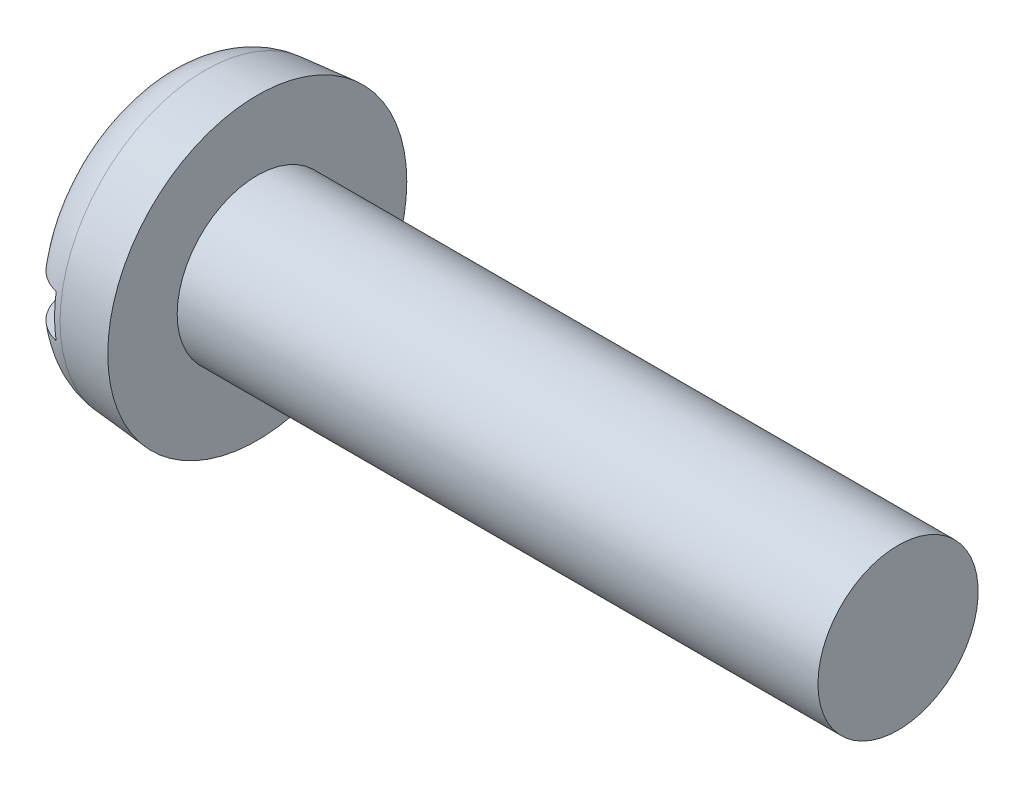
ISO-10303-21;
HEADER;
FILE_DESCRIPTION(('STEP AP214'),'2;1');
FILE_NAME('part.step','',(''),(''),'','','');
FILE_SCHEMA(('AUTOMOTIVE_DESIGN { 1 0 10303 214 1 1 1 1 }'));
ENDSEC;
DATA;
#1=APPLICATION_CONTEXT('core data for automotive mechanical design processes');
#2=APPLICATION_PROTOCOL_DEFINITION('international standard','automotive_design',2000,#1);
#3=PRODUCT_CONTEXT('',#1,'mechanical');
#4=PRODUCT('Part','Part','',(#3));
#5=PRODUCT_RELATED_PRODUCT_CATEGORY('part','',(#4));
#6=PRODUCT_DEFINITION_FORMATION('','',#4);
#7=PRODUCT_DEFINITION_CONTEXT('part definition',#1,'design');
#8=PRODUCT_DEFINITION('design','',#6,#7);
#9=PRODUCT_DEFINITION_SHAPE('','',#8);
#10=(LENGTH_UNIT() NAMED_UNIT(*) SI_UNIT(.MILLI.,.METRE.));
#11=(NAMED_UNIT(*) PLANE_ANGLE_UNIT() SI_UNIT($,.RADIAN.));
#12=(NAMED_UNIT(*) SI_UNIT($,.STERADIAN.) SOLID_ANGLE_UNIT());
#13=UNCERTAINTY_MEASURE_WITH_UNIT(LENGTH_MEASURE(1.E-05),#10,'distance_accuracy_value','');
#14=(GEOMETRIC_REPRESENTATION_CONTEXT(3) GLOBAL_UNCERTAINTY_ASSIGNED_CONTEXT((#13)) GLOBAL_UNIT_ASSIGNED_CONTEXT((#10,
#11,#12)) REPRESENTATION_CONTEXT('',''));
#15=CARTESIAN_POINT('',(0.,0.,0.));
#16=DIRECTION('',(0.,0.,1.));
#17=DIRECTION('',(1.,0.,0.));
#18=AXIS2_PLACEMENT_3D('',#15,#16,#17);
#19=CARTESIAN_POINT('',(0.,0.,0.));
#20=DIRECTION('',(-1.,0.,0.));
#21=DIRECTION('',(0.,0.,1.));
#22=AXIS2_PLACEMENT_3D('',#19,#20,#21);
#23=PLANE('',#22);
#24=DIRECTION('',(0.,0.,-1.));
#25=VECTOR('',#24,1.);
#26=CARTESIAN_POINT('',(0.,0.399999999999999,2.8));
#27=LINE('',#26,#25);
#28=CARTESIAN_POINT('',(0.,0.399999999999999,1.77326763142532));
#29=VERTEX_POINT('',#28);
#30=CARTESIAN_POINT('',(0.,0.399999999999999,-1.77326763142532));
#31=VERTEX_POINT('',#30);
#32=EDGE_CURVE('E85',#29,#31,#27,.T.);
#33=ORIENTED_EDGE('',*,*,#32,.F.);
#34=CARTESIAN_POINT('',(0.,0.,0.));
#35=DIRECTION('',(-1.,0.,0.));
#36=DIRECTION('',(0.,0.,1.));
#37=AXIS2_PLACEMENT_3D('',#34,#35,#36);
#38=CIRCLE('',#37,1.81782234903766);
#39=EDGE_CURVE('E91',#29,#31,#38,.T.);
#40=ORIENTED_EDGE('',*,*,#39,.T.);
#41=EDGE_LOOP('',(#33,#40));
#42=FACE_BOUND('',#41,.T.);
#43=ADVANCED_FACE('F32',(#42),#23,.T.);
#44=CARTESIAN_POINT('',(-25.4,0.,0.));
#45=DIRECTION('',(-1.,0.,0.));
#46=DIRECTION('',(0.,0.,1.));
#47=AXIS2_PLACEMENT_3D('',#44,#45,#46);
#48=CYLINDRICAL_SURFACE('',#47,1.5);
#49=CARTESIAN_POINT('',(13.8,0.,0.));
#50=DIRECTION('',(-1.,0.,0.));
#51=DIRECTION('',(0.,0.,1.));
#52=AXIS2_PLACEMENT_3D('',#49,#50,#51);
#53=CIRCLE('',#52,1.5);
#54=CARTESIAN_POINT('',(13.8,0.,1.5));
#55=VERTEX_POINT('',#54);
#56=EDGE_CURVE('E92',#55,#55,#53,.T.);
#57=ORIENTED_EDGE('',*,*,#56,.T.);
#58=EDGE_LOOP('',(#57));
#59=FACE_BOUND('',#58,.T.);
#60=CARTESIAN_POINT('',(1.8,0.,0.));
#61=DIRECTION('',(-1.,0.,0.));
#62=DIRECTION('',(0.,0.,1.));
#63=AXIS2_PLACEMENT_3D('',#60,#61,#62);
#64=CIRCLE('',#63,1.5);
#65=CARTESIAN_POINT('',(1.8,0.,1.5));
#66=VERTEX_POINT('',#65);
#67=EDGE_CURVE('E149',#66,#66,#64,.T.);
#68=ORIENTED_EDGE('',*,*,#67,.F.);
#69=EDGE_LOOP('',(#68));
#70=FACE_BOUND('',#69,.T.);
#71=ADVANCED_FACE('F137',(#59,#70),#48,.T.);
#72=CARTESIAN_POINT('',(13.8,1.5,0.));
#73=DIRECTION('',(1.,0.,0.));
#74=DIRECTION('',(0.,0.,-1.));
#75=AXIS2_PLACEMENT_3D('',#72,#73,#74);
#76=PLANE('',#75);
#77=ORIENTED_EDGE('',*,*,#56,.F.);
#78=EDGE_LOOP('',(#77));
#79=FACE_BOUND('',#78,.T.);
#80=ADVANCED_FACE('F135',(#79),#76,.T.);
#81=DIRECTION('',(0.,0.,1.));
#82=VECTOR('',#81,1.);
#83=CARTESIAN_POINT('',(0.,-0.4,-2.8));
#84=LINE('',#83,#82);
#85=CARTESIAN_POINT('',(0.,-0.4,-1.77326763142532));
#86=VERTEX_POINT('',#85);
#87=CARTESIAN_POINT('',(0.,-0.4,1.77326763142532));
#88=VERTEX_POINT('',#87);
#89=EDGE_CURVE('E76',#86,#88,#84,.T.);
#90=ORIENTED_EDGE('',*,*,#89,.F.);
#91=EDGE_CURVE('E83',#86,#88,#38,.T.);
#92=ORIENTED_EDGE('',*,*,#91,.T.);
#93=EDGE_LOOP('',(#90,#92));
#94=FACE_BOUND('',#93,.T.);
#95=ADVANCED_FACE('F82',(#94),#23,.T.);
#96=CARTESIAN_POINT('',(0.,0.,0.));
#97=DIRECTION('',(1.,0.,0.));
#98=DIRECTION('',(0.,0.,-1.));
#99=AXIS2_PLACEMENT_3D('',#96,#97,#98);
#100=CONICAL_SURFACE('',#99,2.64252040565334,0.087266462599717);
#101=CARTESIAN_POINT('',(0.821559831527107,0.,0.));
#102=DIRECTION('',(-1.,0.,0.));
#103=DIRECTION('',(0.,0.,1.));
#104=AXIS2_PLACEMENT_3D('',#101,#102,#103);
#105=CIRCLE('',#104,2.71439757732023);
#106=CARTESIAN_POINT('',(0.821559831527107,0.,2.71439757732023));
#107=VERTEX_POINT('',#106);
#108=EDGE_CURVE('E95',#107,#107,#105,.F.);
#109=ORIENTED_EDGE('',*,*,#108,.T.);
#110=EDGE_LOOP('',(#109));
#111=FACE_BOUND('',#110,.T.);
#112=CARTESIAN_POINT('',(1.8,0.,0.));
#113=DIRECTION('',(-1.,0.,0.));
#114=DIRECTION('',(0.,0.,1.));
#115=AXIS2_PLACEMENT_3D('',#112,#113,#114);
#116=CIRCLE('',#115,2.8);
#117=CARTESIAN_POINT('',(1.8,0.,2.8));
#118=VERTEX_POINT('',#117);
#119=EDGE_CURVE('E97',#118,#118,#116,.T.);
#120=ORIENTED_EDGE('',*,*,#119,.T.);
#121=EDGE_LOOP('',(#120));
#122=FACE_BOUND('',#121,.T.);
#123=ADVANCED_FACE('F128',(#111,#122),#100,.T.);
#124=CARTESIAN_POINT('',(1.8,1.5,0.));
#125=DIRECTION('',(-1.,0.,0.));
#126=DIRECTION('',(0.,0.,1.));
#127=AXIS2_PLACEMENT_3D('',#124,#125,#126);
#128=PLANE('',#127);
#129=ORIENTED_EDGE('',*,*,#119,.F.);
#130=EDGE_LOOP('',(#129));
#131=FACE_BOUND('',#130,.T.);
#132=ORIENTED_EDGE('',*,*,#67,.T.);
#133=EDGE_LOOP('',(#132));
#134=FACE_BOUND('',#133,.T.);
#135=ADVANCED_FACE('F124',(#131,#134),#128,.F.);
#136=CARTESIAN_POINT('',(0.9,0.,0.));
#137=DIRECTION('',(-1.,0.,0.));
#138=DIRECTION('',(0.,0.,1.));
#139=AXIS2_PLACEMENT_3D('',#136,#137,#138);
#140=TOROIDAL_SURFACE('',#139,1.81782234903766,0.9);
#141=CARTESIAN_POINT('',(0.285780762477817,0.399999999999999,-2.44311963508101));
#142=CARTESIAN_POINT('',(0.322325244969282,0.399999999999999,-2.47769297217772));
#143=CARTESIAN_POINT('',(0.361794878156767,0.399999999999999,-2.50922544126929));
#144=CARTESIAN_POINT('',(0.445493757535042,0.399999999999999,-2.56525291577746));
#145=CARTESIAN_POINT('',(0.48972822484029,0.399999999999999,-2.58974009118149));
#146=CARTESIAN_POINT('',(0.581685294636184,0.399999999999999,-2.63091846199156));
#147=CARTESIAN_POINT('',(0.629407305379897,0.399999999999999,-2.64761097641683));
#148=CARTESIAN_POINT('',(0.726972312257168,0.399999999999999,-2.67270033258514));
#149=CARTESIAN_POINT('',(0.776814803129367,0.399999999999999,-2.68109913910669));
#150=CARTESIAN_POINT('',(0.876977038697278,0.399999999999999,-2.68933922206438));
#151=CARTESIAN_POINT('',(0.92729364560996,0.399999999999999,-2.68921866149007));
#152=CARTESIAN_POINT('',(1.02719093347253,0.399999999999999,-2.68051830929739));
#153=CARTESIAN_POINT('',(1.07677160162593,0.399999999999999,-2.67193837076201));
#154=CARTESIAN_POINT('',(1.17371760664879,0.399999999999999,-2.6465919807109));
#155=CARTESIAN_POINT('',(1.2210859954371,0.399999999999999,-2.62983719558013));
#156=CARTESIAN_POINT('',(1.31235127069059,0.399999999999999,-2.58864040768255));
#157=CARTESIAN_POINT('',(1.35624813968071,0.399999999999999,-2.56419836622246));
#158=CARTESIAN_POINT('',(1.43950339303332,0.399999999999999,-2.50824069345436));
#159=CARTESIAN_POINT('',(1.47884484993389,0.399999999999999,-2.47669988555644));
#160=CARTESIAN_POINT('',(1.55173067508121,0.399999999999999,-2.40751412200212));
#161=CARTESIAN_POINT('',(1.5852748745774,0.399999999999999,-2.36986898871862));
#162=CARTESIAN_POINT('',(1.64594872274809,0.399999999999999,-2.28919528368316));
#163=CARTESIAN_POINT('',(1.67301846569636,0.399999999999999,-2.24612167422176));
#164=CARTESIAN_POINT('',(1.71966197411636,0.399999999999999,-2.15609376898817));
#165=CARTESIAN_POINT('',(1.73923530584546,0.399999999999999,-2.10913924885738));
#166=CARTESIAN_POINT('',(1.77066025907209,0.399999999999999,-2.01194193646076));
#167=CARTESIAN_POINT('',(1.78239254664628,0.399999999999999,-1.96166058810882));
#168=CARTESIAN_POINT('',(1.7974373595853,0.399999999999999,-1.85985639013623));
#169=CARTESIAN_POINT('',(1.80074908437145,0.399999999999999,-1.80833342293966));
#170=CARTESIAN_POINT('',(1.79894832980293,0.399999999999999,-1.70434405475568));
#171=CARTESIAN_POINT('',(1.79365584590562,0.399999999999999,-1.651880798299));
#172=CARTESIAN_POINT('',(1.77456092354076,0.399999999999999,-1.54852841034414));
#173=CARTESIAN_POINT('',(1.76075741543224,0.399999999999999,-1.49763947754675));
#174=CARTESIAN_POINT('',(1.7246504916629,0.399999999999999,-1.3975266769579));
#175=CARTESIAN_POINT('',(1.70214283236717,0.399999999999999,-1.34837644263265));
#176=CARTESIAN_POINT('',(1.64933120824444,0.399999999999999,-1.25444995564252));
#177=CARTESIAN_POINT('',(1.6190255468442,0.399999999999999,-1.20967465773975));
#178=CARTESIAN_POINT('',(1.55085214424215,0.399999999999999,-1.12504927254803));
#179=CARTESIAN_POINT('',(1.51286662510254,0.399999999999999,-1.08529386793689));
#180=CARTESIAN_POINT('',(1.4306134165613,0.399999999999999,-1.01288372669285));
#181=CARTESIAN_POINT('',(1.38634513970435,0.399999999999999,-0.980229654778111));
#182=CARTESIAN_POINT('',(1.29378824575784,0.399999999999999,-0.924048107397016));
#183=CARTESIAN_POINT('',(1.24562231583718,0.399999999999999,-0.900319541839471));
#184=CARTESIAN_POINT('',(1.14574424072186,0.399999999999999,-0.862177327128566));
#185=CARTESIAN_POINT('',(1.09403573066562,0.399999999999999,-0.847754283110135));
#186=CARTESIAN_POINT('',(0.993395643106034,0.399999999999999,-0.830011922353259));
#187=CARTESIAN_POINT('',(0.944615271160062,0.399999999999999,-0.825833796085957));
#188=CARTESIAN_POINT('',(0.847107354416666,0.399999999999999,-0.826334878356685));
#189=CARTESIAN_POINT('',(0.798379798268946,0.399999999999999,-0.831011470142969));
#190=CARTESIAN_POINT('',(0.705495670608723,0.399999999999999,-0.848340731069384));
#191=CARTESIAN_POINT('',(0.661242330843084,0.399999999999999,-0.860484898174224));
#192=CARTESIAN_POINT('',(0.575232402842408,0.399999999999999,-0.891650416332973));
#193=CARTESIAN_POINT('',(0.53347652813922,0.399999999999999,-0.910673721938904));
#194=CARTESIAN_POINT('',(0.451191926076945,0.399999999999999,-0.956010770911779));
#195=CARTESIAN_POINT('',(0.410848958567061,0.399999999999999,-0.982660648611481));
#196=CARTESIAN_POINT('',(0.334722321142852,0.399999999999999,-1.04182188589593));
#197=CARTESIAN_POINT('',(0.298940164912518,0.399999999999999,-1.0743351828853));
#198=CARTESIAN_POINT('',(0.229649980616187,0.399999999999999,-1.14749226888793));
#199=CARTESIAN_POINT('',(0.19663491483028,0.399999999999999,-1.18860403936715));
#200=CARTESIAN_POINT('',(0.137645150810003,0.399999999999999,-1.27560624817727));
#201=CARTESIAN_POINT('',(0.111672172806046,0.399999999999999,-1.32149785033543));
#202=CARTESIAN_POINT('',(0.0665593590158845,0.399999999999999,-1.41881690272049));
#203=CARTESIAN_POINT('',(0.0477401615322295,0.399999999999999,-1.47039354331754));
#204=CARTESIAN_POINT('',(0.0191028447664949,0.399999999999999,-1.57598967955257));
#205=CARTESIAN_POINT('',(0.0092842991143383,0.399999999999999,-1.63000905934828));
#206=CARTESIAN_POINT('',(-0.000908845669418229,0.399999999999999,-1.73850050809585));
#207=CARTESIAN_POINT('',(-0.00135843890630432,0.399999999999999,-1.7929654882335));
#208=CARTESIAN_POINT('',(0.00713794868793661,0.399999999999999,-1.90117587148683));
#209=CARTESIAN_POINT('',(0.0160852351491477,0.399999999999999,-1.9549211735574));
#210=CARTESIAN_POINT('',(0.0428869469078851,0.399999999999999,-2.05874477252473));
#211=CARTESIAN_POINT('',(0.0605196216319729,0.399999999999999,-2.10888044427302));
#212=CARTESIAN_POINT('',(0.104140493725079,0.399999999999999,-2.20532358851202));
#213=CARTESIAN_POINT('',(0.130117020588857,0.399999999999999,-2.25163629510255));
#214=CARTESIAN_POINT('',(0.178150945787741,0.399999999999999,-2.32211375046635));
#215=CARTESIAN_POINT('',(0.197843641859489,0.399999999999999,-2.34792122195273));
#216=CARTESIAN_POINT('',(0.239879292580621,0.399999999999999,-2.39728022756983));
#217=CARTESIAN_POINT('',(0.26222221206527,0.399999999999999,-2.42083179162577));
#218=CARTESIAN_POINT('',(0.285780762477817,0.399999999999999,-2.44311963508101));
#219=B_SPLINE_CURVE_WITH_KNOTS('',3,(#141,#142,#143,#144,#145,#146,#147,#148,#149,#150,#151,
#152,#153,#154,#155,#156,#157,#158,#159,#160,#161,#162,#163,#164,#165,#166,#167,#168,#169,#170,
#171,#172,#173,#174,#175,#176,#177,#178,#179,#180,#181,#182,#183,#184,#185,#186,#187,#188,#189,
#190,#191,#192,#193,#194,#195,#196,#197,#198,#199,#200,#201,#202,#203,#204,#205,#206,#207,#208,
#209,#210,#211,#212,#213,#214,#215,#216,#217,#218),.UNSPECIFIED.,.T.,.F.,(4,2,2,2,2,2,2,2,2,2,2,
2,2,2,2,2,2,2,2,2,2,2,2,2,2,2,2,2,2,2,2,2,2,2,2,2,2,2,4),(0.,0.15080428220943,0.301775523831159,
0.452721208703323,0.603631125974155,0.753865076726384,0.904101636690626,1.05412441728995,
1.2041479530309,1.35471219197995,1.50528081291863,1.65719291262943,1.80911380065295,
1.96329712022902,2.11749509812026,2.27496068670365,2.43244606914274,2.59387611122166,
2.75534130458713,2.9195015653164,3.08367718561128,3.24389389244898,3.40394859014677,
3.55004213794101,3.69609251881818,3.83315592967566,3.97025831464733,4.11470991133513,
4.25920932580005,4.41668805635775,4.57420522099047,4.73812462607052,4.90203626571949,
5.06463536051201,5.22725705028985,5.38592661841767,5.54437521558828,5.64159310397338,
5.73880970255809),.UNSPECIFIED.);
#220=CARTESIAN_POINT('',(0.7,0.399999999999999,-2.66547244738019));
#221=VERTEX_POINT('',#220);
#222=EDGE_CURVE('E11',#31,#221,#219,.T.);
#223=ORIENTED_EDGE('',*,*,#222,.F.);
#224=ORIENTED_EDGE('',*,*,#39,.F.);
#225=CARTESIAN_POINT('',(0.356169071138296,0.399999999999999,1.02545886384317));
#226=CARTESIAN_POINT('',(0.394477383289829,0.399999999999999,0.994276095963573));
#227=CARTESIAN_POINT('',(0.435252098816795,0.399999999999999,0.966090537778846));
#228=CARTESIAN_POINT('',(0.520874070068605,0.399999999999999,0.916713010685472));
#229=CARTESIAN_POINT('',(0.56572297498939,0.399999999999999,0.895523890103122));
#230=CARTESIAN_POINT('',(0.658585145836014,0.399999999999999,0.861072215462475));
#231=CARTESIAN_POINT('',(0.706609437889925,0.399999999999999,0.84783908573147));
#232=CARTESIAN_POINT('',(0.80424325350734,0.399999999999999,0.83024223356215));
#233=CARTESIAN_POINT('',(0.853851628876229,0.399999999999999,0.825872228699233));
#234=CARTESIAN_POINT('',(0.950010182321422,0.399999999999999,0.826277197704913));
#235=CARTESIAN_POINT('',(0.99656347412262,0.399999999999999,0.830513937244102));
#236=CARTESIAN_POINT('',(1.08828168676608,0.399999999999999,0.846797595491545));
#237=CARTESIAN_POINT('',(1.1334463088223,0.399999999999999,0.858846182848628));
#238=CARTESIAN_POINT('',(1.22099947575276,0.399999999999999,0.890027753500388));
#239=CARTESIAN_POINT('',(1.26339999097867,0.399999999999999,0.909127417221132));
#240=CARTESIAN_POINT('',(1.34475562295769,0.399999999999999,0.953613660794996));
#241=CARTESIAN_POINT('',(1.38370973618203,0.399999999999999,0.979002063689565));
#242=CARTESIAN_POINT('',(1.4606297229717,0.399999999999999,1.03768873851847));
#243=CARTESIAN_POINT('',(1.49821861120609,0.399999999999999,1.07148126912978));
#244=CARTESIAN_POINT('',(1.56766557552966,0.399999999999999,1.14451739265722));
#245=CARTESIAN_POINT('',(1.59952174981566,0.399999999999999,1.18376278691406));
#246=CARTESIAN_POINT('',(1.65882951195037,0.399999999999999,1.26965174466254));
#247=CARTESIAN_POINT('',(1.68580874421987,0.399999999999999,1.3166225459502));
#248=CARTESIAN_POINT('',(1.7316261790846,0.399999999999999,1.41438438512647));
#249=CARTESIAN_POINT('',(1.7504634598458,0.399999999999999,1.46517585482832));
#250=CARTESIAN_POINT('',(1.77959171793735,0.399999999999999,1.56990546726));
#251=CARTESIAN_POINT('',(1.78976336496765,0.399999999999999,1.62387693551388));
#252=CARTESIAN_POINT('',(1.80070617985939,0.399999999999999,1.73276786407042));
#253=CARTESIAN_POINT('',(1.80147810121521,0.399999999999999,1.78768724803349));
#254=CARTESIAN_POINT('',(1.7935515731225,0.399999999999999,1.89576039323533));
#255=CARTESIAN_POINT('',(1.78503812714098,0.399999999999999,1.94892767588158));
#256=CARTESIAN_POINT('',(1.75897009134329,0.399999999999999,2.05299963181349));
#257=CARTESIAN_POINT('',(1.74141670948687,0.399999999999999,2.10390460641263));
#258=CARTESIAN_POINT('',(1.69825810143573,0.399999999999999,2.20064023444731));
#259=CARTESIAN_POINT('',(1.67286703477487,0.399999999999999,2.24656646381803));
#260=CARTESIAN_POINT('',(1.61458416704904,0.399999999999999,2.33338474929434));
#261=CARTESIAN_POINT('',(1.58169323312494,0.399999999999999,2.37427738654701));
#262=CARTESIAN_POINT('',(1.51007060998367,0.399999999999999,2.44900649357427));
#263=CARTESIAN_POINT('',(1.47146964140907,0.399999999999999,2.48296829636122));
#264=CARTESIAN_POINT('',(1.38904817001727,0.399999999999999,2.54382334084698));
#265=CARTESIAN_POINT('',(1.34522808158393,0.399999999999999,2.57071714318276));
#266=CARTESIAN_POINT('',(1.25424836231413,0.399999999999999,2.61630908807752));
#267=CARTESIAN_POINT('',(1.20714119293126,0.399999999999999,2.63511196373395));
#268=CARTESIAN_POINT('',(1.11042474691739,0.399999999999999,2.66447616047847));
#269=CARTESIAN_POINT('',(1.06081558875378,0.399999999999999,2.67503787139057));
#270=CARTESIAN_POINT('',(0.960893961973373,0.399999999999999,2.68755622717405));
#271=CARTESIAN_POINT('',(0.910589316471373,0.399999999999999,2.68957539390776));
#272=CARTESIAN_POINT('',(0.810358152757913,0.399999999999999,2.68512046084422));
#273=CARTESIAN_POINT('',(0.760431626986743,0.399999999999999,2.67864653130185));
#274=CARTESIAN_POINT('',(0.662478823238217,0.399999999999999,2.65741995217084));
#275=CARTESIAN_POINT('',(0.614448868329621,0.399999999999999,2.64268425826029));
#276=CARTESIAN_POINT('',(0.521534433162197,0.399999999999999,2.60538142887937));
#277=CARTESIAN_POINT('',(0.476649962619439,0.399999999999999,2.58281426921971));
#278=CARTESIAN_POINT('',(0.391148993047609,0.399999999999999,2.53043182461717));
#279=CARTESIAN_POINT('',(0.350545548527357,0.399999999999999,2.50059523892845));
#280=CARTESIAN_POINT('',(0.274874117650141,0.399999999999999,2.43457977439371));
#281=CARTESIAN_POINT('',(0.239806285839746,0.399999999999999,2.39840071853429));
#282=CARTESIAN_POINT('',(0.1758792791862,0.399999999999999,2.32042102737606));
#283=CARTESIAN_POINT('',(0.147073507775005,0.399999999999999,2.27857662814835));
#284=CARTESIAN_POINT('',(0.0967847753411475,0.399999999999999,2.19069995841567));
#285=CARTESIAN_POINT('',(0.07530224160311,0.399999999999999,2.14466744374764));
#286=CARTESIAN_POINT('',(0.0399276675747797,0.399999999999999,2.04903409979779));
#287=CARTESIAN_POINT('',(0.0261471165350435,0.399999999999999,1.99939205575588));
#288=CARTESIAN_POINT('',(0.00693602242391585,0.399999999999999,1.89852251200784));
#289=CARTESIAN_POINT('',(0.00150590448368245,0.399999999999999,1.84729493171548));
#290=CARTESIAN_POINT('',(-0.000985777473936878,0.399999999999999,1.74359522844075));
#291=CARTESIAN_POINT('',(0.0021251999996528,0.399999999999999,1.69111899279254));
#292=CARTESIAN_POINT('',(0.0168916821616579,0.399999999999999,1.58737297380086));
#293=CARTESIAN_POINT('',(0.0285499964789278,0.399999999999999,1.53610359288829));
#294=CARTESIAN_POINT('',(0.0604020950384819,0.399999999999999,1.43486374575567));
#295=CARTESIAN_POINT('',(0.080804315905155,0.399999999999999,1.38495893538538));
#296=CARTESIAN_POINT('',(0.129530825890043,0.399999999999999,1.28921347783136));
#297=CARTESIAN_POINT('',(0.157849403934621,0.399999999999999,1.24336993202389));
#298=CARTESIAN_POINT('',(0.213684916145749,0.399999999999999,1.16773658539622));
#299=CARTESIAN_POINT('',(0.239651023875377,0.399999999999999,1.13678903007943));
#300=CARTESIAN_POINT('',(0.29525297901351,0.399999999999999,1.07838116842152));
#301=CARTESIAN_POINT('',(0.324888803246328,0.399999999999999,1.05092084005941));
#302=CARTESIAN_POINT('',(0.356169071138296,0.399999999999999,1.02545886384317));
#303=B_SPLINE_CURVE_WITH_KNOTS('',3,(#225,#226,#227,#228,#229,#230,#231,#232,#233,#234,#235,
#236,#237,#238,#239,#240,#241,#242,#243,#244,#245,#246,#247,#248,#249,#250,#251,#252,#253,#254,
#255,#256,#257,#258,#259,#260,#261,#262,#263,#264,#265,#266,#267,#268,#269,#270,#271,#272,#273,
#274,#275,#276,#277,#278,#279,#280,#281,#282,#283,#284,#285,#286,#287,#288,#289,#290,#291,#292,
#293,#294,#295,#296,#297,#298,#299,#300,#301,#302),.UNSPECIFIED.,.T.,.F.,(4,2,2,2,2,2,2,2,2,2,2,
2,2,2,2,2,2,2,2,2,2,2,2,2,2,2,2,2,2,2,2,2,2,2,2,2,2,2,4),(0.,0.148056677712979,
0.296173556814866,0.444834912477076,0.593390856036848,0.732942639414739,0.87252424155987,
1.01145452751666,1.15042513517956,1.30141738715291,1.45245963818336,1.61420969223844,
1.7759780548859,1.93993961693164,2.10388803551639,2.26462860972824,2.42534771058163,
2.58201478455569,2.73866375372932,2.89216335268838,3.04565077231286,3.19708679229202,
3.34851564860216,3.49883427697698,3.64914989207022,3.79915813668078,3.94916684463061,
4.09962050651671,4.25007836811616,4.40177296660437,4.55347641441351,4.70732244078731,
4.86117629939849,5.0181609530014,5.17519723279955,5.33620557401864,5.49709805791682,
5.61799301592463,5.73888721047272),.UNSPECIFIED.);
#304=CARTESIAN_POINT('',(0.7,0.399999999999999,2.66547244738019));
#305=VERTEX_POINT('',#304);
#306=EDGE_CURVE('E109',#305,#29,#303,.T.);
#307=ORIENTED_EDGE('',*,*,#306,.F.);
#308=CARTESIAN_POINT('',(0.7,0.,0.));
#309=DIRECTION('',(-1.,0.,0.));
#310=DIRECTION('',(0.,0.,1.));
#311=AXIS2_PLACEMENT_3D('',#308,#309,#310);
#312=CIRCLE('',#311,2.69531878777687);
#313=CARTESIAN_POINT('',(0.7,-0.4,2.66547244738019));
#314=VERTEX_POINT('',#313);
#315=EDGE_CURVE('E103',#305,#314,#312,.F.);
#316=ORIENTED_EDGE('',*,*,#315,.T.);
#317=CARTESIAN_POINT('',(0.356169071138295,-0.4,1.02545886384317));
#318=CARTESIAN_POINT('',(0.314031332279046,-0.4,1.05976167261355));
#319=CARTESIAN_POINT('',(0.274819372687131,-0.4,1.0977427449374));
#320=CARTESIAN_POINT('',(0.20326819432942,-0.4,1.17978565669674));
#321=CARTESIAN_POINT('',(0.170942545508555,-0.4,1.22385922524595));
#322=CARTESIAN_POINT('',(0.114111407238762,-0.4,1.31672727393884));
#323=CARTESIAN_POINT('',(0.0895968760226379,-0.4,1.36551620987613));
#324=CARTESIAN_POINT('',(0.0490785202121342,-0.4,1.46648183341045));
#325=CARTESIAN_POINT('',(0.0330703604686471,-0.4,1.51865678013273));
#326=CARTESIAN_POINT('',(0.0100453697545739,-0.4,1.62518908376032));
#327=CARTESIAN_POINT('',(0.00306618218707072,-0.4,1.67955460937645));
#328=CARTESIAN_POINT('',(-0.00144685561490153,-0.4,1.78868546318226));
#329=CARTESIAN_POINT('',(0.00101939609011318,-0.4,1.84345079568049));
#330=CARTESIAN_POINT('',(0.0152891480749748,-0.4,1.95052330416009));
#331=CARTESIAN_POINT('',(0.0268854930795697,-0.4,2.0028580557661));
#332=CARTESIAN_POINT('',(0.0589248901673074,-0.4,2.10474672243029));
#333=CARTESIAN_POINT('',(0.0793666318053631,-0.4,2.15430104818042));
#334=CARTESIAN_POINT('',(0.12795627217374,-0.4,2.24792186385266));
#335=CARTESIAN_POINT('',(0.155901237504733,-0.4,2.29209371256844));
#336=CARTESIAN_POINT('',(0.218944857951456,-0.4,2.37499861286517));
#337=CARTESIAN_POINT('',(0.254042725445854,-0.4,2.41373226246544));
#338=CARTESIAN_POINT('',(0.32966685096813,-0.4,2.48389534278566));
#339=CARTESIAN_POINT('',(0.370077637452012,-0.4,2.51544927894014));
#340=CARTESIAN_POINT('',(0.455677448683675,-0.4,2.57122459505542));
#341=CARTESIAN_POINT('',(0.500866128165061,-0.4,2.59544650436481));
#342=CARTESIAN_POINT('',(0.59413782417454,-0.4,2.6355729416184));
#343=CARTESIAN_POINT('',(0.642178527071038,-0.4,2.65157587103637));
#344=CARTESIAN_POINT('',(0.740273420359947,-0.4,2.67523109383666));
#345=CARTESIAN_POINT('',(0.790327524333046,-0.4,2.68288374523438));
#346=CARTESIAN_POINT('',(0.890686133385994,-0.4,2.68958762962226));
#347=CARTESIAN_POINT('',(0.940986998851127,-0.4,2.68869347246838));
#348=CARTESIAN_POINT('',(1.04072178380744,-0.4,2.67846167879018));
#349=CARTESIAN_POINT('',(1.0901557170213,-0.4,2.66912417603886));
#350=CARTESIAN_POINT('',(1.18669599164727,-0.4,2.64229877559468));
#351=CARTESIAN_POINT('',(1.23380501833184,-0.4,2.6248205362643));
#352=CARTESIAN_POINT('',(1.32443528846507,-0.4,2.58223220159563));
#353=CARTESIAN_POINT('',(1.36795650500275,-0.4,2.5571220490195));
#354=CARTESIAN_POINT('',(1.45036421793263,-0.4,2.49989362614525));
#355=CARTESIAN_POINT('',(1.48923230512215,-0.4,2.46774885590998));
#356=CARTESIAN_POINT('',(1.56107927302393,-0.4,2.39744378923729));
#357=CARTESIAN_POINT('',(1.59405796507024,-0.4,2.35928330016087));
#358=CARTESIAN_POINT('',(1.65352847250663,-0.4,2.2776666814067));
#359=CARTESIAN_POINT('',(1.67995797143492,-0.4,2.23416516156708));
#360=CARTESIAN_POINT('',(1.72526137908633,-0.4,2.14339421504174));
#361=CARTESIAN_POINT('',(1.74413484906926,-0.4,2.09612456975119));
#362=CARTESIAN_POINT('',(1.77411508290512,-0.4,1.9983989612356));
#363=CARTESIAN_POINT('',(1.78509960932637,-0.4,1.9479055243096));
#364=CARTESIAN_POINT('',(1.79862667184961,-0.4,1.84580292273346));
#365=CARTESIAN_POINT('',(1.80116838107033,-0.4,1.79419364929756));
#366=CARTESIAN_POINT('',(1.79780993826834,-0.4,1.69014314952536));
#367=CARTESIAN_POINT('',(1.79172746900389,-0.4,1.63770783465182));
#368=CARTESIAN_POINT('',(1.77106806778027,-0.4,1.53454005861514));
#369=CARTESIAN_POINT('',(1.75649007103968,-0.4,1.48380781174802));
#370=CARTESIAN_POINT('',(1.7188487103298,-0.4,1.38413781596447));
#371=CARTESIAN_POINT('',(1.69558194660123,-0.4,1.33527684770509));
#372=CARTESIAN_POINT('',(1.64130257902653,-0.4,1.24205401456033));
#373=CARTESIAN_POINT('',(1.6102882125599,-0.4,1.19769317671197));
#374=CARTESIAN_POINT('',(1.54078360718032,-0.4,1.11407031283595));
#375=CARTESIAN_POINT('',(1.50218355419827,-0.4,1.07489936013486));
#376=CARTESIAN_POINT('',(1.418793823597,-0.4,1.00377929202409));
#377=CARTESIAN_POINT('',(1.37400377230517,-0.4,0.971830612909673));
#378=CARTESIAN_POINT('',(1.28066227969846,-0.4,0.917245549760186));
#379=CARTESIAN_POINT('',(1.23224470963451,-0.4,0.894381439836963));
#380=CARTESIAN_POINT('',(1.13202516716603,-0.4,0.858023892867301));
#381=CARTESIAN_POINT('',(1.08022692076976,-0.4,0.844520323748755));
#382=CARTESIAN_POINT('',(0.979686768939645,-0.4,0.828554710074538));
#383=CARTESIAN_POINT('',(0.93108358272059,-0.4,0.82521631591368));
#384=CARTESIAN_POINT('',(0.834057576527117,-0.4,0.827306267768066));
#385=CARTESIAN_POINT('',(0.785634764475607,-0.4,0.832734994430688));
#386=CARTESIAN_POINT('',(0.693219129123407,-0.4,0.851440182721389));
#387=CARTESIAN_POINT('',(0.6491307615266,-0.4,0.864254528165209));
#388=CARTESIAN_POINT('',(0.563580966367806,-0.4,0.896690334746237));
#389=CARTESIAN_POINT('',(0.522117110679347,-0.4,0.916305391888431));
#390=CARTESIAN_POINT('',(0.460201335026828,-0.4,0.951554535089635));
#391=CARTESIAN_POINT('',(0.438547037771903,-0.4,0.965129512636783));
#392=CARTESIAN_POINT('',(0.396436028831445,-0.4,0.994018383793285));
#393=CARTESIAN_POINT('',(0.375979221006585,-0.4,1.00933213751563));
#394=CARTESIAN_POINT('',(0.356169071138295,-0.4,1.02545886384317));
#395=B_SPLINE_CURVE_WITH_KNOTS('',3,(#317,#318,#319,#320,#321,#322,#323,#324,#325,#326,#327,
#328,#329,#330,#331,#332,#333,#334,#335,#336,#337,#338,#339,#340,#341,#342,#343,#344,#345,#346,
#347,#348,#349,#350,#351,#352,#353,#354,#355,#356,#357,#358,#359,#360,#361,#362,#363,#364,#365,
#366,#367,#368,#369,#370,#371,#372,#373,#374,#375,#376,#377,#378,#379,#380,#381,#382,#383,#384,
#385,#386,#387,#388,#389,#390,#391,#392,#393,#394),.UNSPECIFIED.,.T.,.F.,(4,2,2,2,2,2,2,2,2,2,2,
2,2,2,2,2,2,2,2,2,2,2,2,2,2,2,2,2,2,2,2,2,2,2,2,2,2,2,4),(0.,0.162908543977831,
0.326135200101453,0.489172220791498,0.652126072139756,0.815757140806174,0.979389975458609,
1.13941349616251,1.29941331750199,1.45545894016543,1.61148738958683,1.76455910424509,
1.91761976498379,2.068802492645,2.21997873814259,2.37018969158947,2.52039826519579,
2.67042907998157,2.82046101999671,2.97106818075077,3.12168016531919,3.27367450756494,
3.42567767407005,3.5799880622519,3.73431356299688,3.89195060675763,4.04960741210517,
4.2112132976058,4.37285598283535,4.53703863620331,4.70123120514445,4.86099956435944,
5.02059471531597,5.16597452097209,5.31136063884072,5.44850857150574,5.58552770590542,
5.66212180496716,5.73870974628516),.UNSPECIFIED.);
#396=EDGE_CURVE('E90',#88,#314,#395,.T.);
#397=ORIENTED_EDGE('',*,*,#396,.F.);
#398=ORIENTED_EDGE('',*,*,#91,.F.);
#399=CARTESIAN_POINT('',(0.285780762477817,-0.4,-2.44311963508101));
#400=CARTESIAN_POINT('',(0.248557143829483,-0.4,-2.4078972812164));
#401=CARTESIAN_POINT('',(0.214312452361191,-0.4,-2.3694650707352));
#402=CARTESIAN_POINT('',(0.152768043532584,-0.4,-2.28733938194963));
#403=CARTESIAN_POINT('',(0.125478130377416,-0.4,-2.24363860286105));
#404=CARTESIAN_POINT('',(0.0786257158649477,-0.4,-2.15234079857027));
#405=CARTESIAN_POINT('',(0.0590537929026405,-0.4,-2.10474861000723));
#406=CARTESIAN_POINT('',(0.0280650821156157,-0.4,-2.00700047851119));
#407=CARTESIAN_POINT('',(0.0166461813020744,-0.4,-1.95684520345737));
#408=CARTESIAN_POINT('',(0.00206923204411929,-0.4,-1.85464080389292));
#409=CARTESIAN_POINT('',(-0.000972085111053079,-0.4,-1.80257506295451));
#410=CARTESIAN_POINT('',(0.00151453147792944,-0.4,-1.69864852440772));
#411=CARTESIAN_POINT('',(0.00704382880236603,-0.4,-1.64678776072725));
#412=CARTESIAN_POINT('',(0.0266516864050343,-0.4,-1.5434240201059));
#413=CARTESIAN_POINT('',(0.0409314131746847,-0.4,-1.49195921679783));
#414=CARTESIAN_POINT('',(0.0777275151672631,-0.4,-1.39206285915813));
#415=CARTESIAN_POINT('',(0.100245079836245,-0.4,-1.34363174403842));
#416=CARTESIAN_POINT('',(0.153482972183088,-0.4,-1.2500005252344));
#417=CARTESIAN_POINT('',(0.184382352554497,-0.4,-1.20490211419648));
#418=CARTESIAN_POINT('',(0.253306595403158,-0.4,-1.12049761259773));
#419=CARTESIAN_POINT('',(0.29133345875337,-0.4,-1.08119315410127));
#420=CARTESIAN_POINT('',(0.373599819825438,-0.4,-1.00962170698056));
#421=CARTESIAN_POINT('',(0.417845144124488,-0.4,-0.977361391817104));
#422=CARTESIAN_POINT('',(0.511393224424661,-0.4,-0.921257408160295));
#423=CARTESIAN_POINT('',(0.560693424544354,-0.4,-0.897409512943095));
#424=CARTESIAN_POINT('',(0.659899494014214,-0.4,-0.86056620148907));
#425=CARTESIAN_POINT('',(0.709596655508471,-0.4,-0.847011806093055));
#426=CARTESIAN_POINT('',(0.81063175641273,-0.4,-0.829407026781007));
#427=CARTESIAN_POINT('',(0.861968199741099,-0.4,-0.825348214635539));
#428=CARTESIAN_POINT('',(0.959752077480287,-0.4,-0.82693832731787));
#429=CARTESIAN_POINT('',(1.00621575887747,-0.4,-0.831730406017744));
#430=CARTESIAN_POINT('',(1.09766854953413,-0.4,-0.849077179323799));
#431=CARTESIAN_POINT('',(1.14265739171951,-0.4,-0.861633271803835));
#432=CARTESIAN_POINT('',(1.2299114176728,-0.4,-0.893807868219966));
#433=CARTESIAN_POINT('',(1.27218175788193,-0.4,-0.913412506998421));
#434=CARTESIAN_POINT('',(1.35320643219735,-0.4,-0.958874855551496));
#435=CARTESIAN_POINT('',(1.39195973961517,-0.4,-0.984734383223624));
#436=CARTESIAN_POINT('',(1.46843970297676,-0.4,-1.04440221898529));
#437=CARTESIAN_POINT('',(1.5057776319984,-0.4,-1.07870901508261));
#438=CARTESIAN_POINT('',(1.57463408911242,-0.4,-1.15273784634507));
#439=CARTESIAN_POINT('',(1.60615068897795,-0.4,-1.19246166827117));
#440=CARTESIAN_POINT('',(1.66460952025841,-0.4,-1.27921419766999));
#441=CARTESIAN_POINT('',(1.69108592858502,-0.4,-1.32655784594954));
#442=CARTESIAN_POINT('',(1.73582713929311,-0.4,-1.42498260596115));
#443=CARTESIAN_POINT('',(1.75409110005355,-0.4,-1.47606410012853));
#444=CARTESIAN_POINT('',(1.7819800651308,-0.4,-1.58118959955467));
#445=CARTESIAN_POINT('',(1.79150042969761,-0.4,-1.63526148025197));
#446=CARTESIAN_POINT('',(1.80112725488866,-0.4,-1.74424014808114));
#447=CARTESIAN_POINT('',(1.80123449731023,-0.4,-1.79914686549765));
#448=CARTESIAN_POINT('',(1.79200090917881,-0.4,-1.90704889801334));
#449=CARTESIAN_POINT('',(1.78285023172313,-0.4,-1.96006044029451));
#450=CARTESIAN_POINT('',(1.75554489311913,-0.4,-2.06371351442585));
#451=CARTESIAN_POINT('',(1.73739144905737,-0.4,-2.11435536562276));
#452=CARTESIAN_POINT('',(1.69310212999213,-0.4,-2.21047686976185));
#453=CARTESIAN_POINT('',(1.66717834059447,-0.4,-2.25605427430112));
#454=CARTESIAN_POINT('',(1.60789945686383,-0.4,-2.34209023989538));
#455=CARTESIAN_POINT('',(1.57454519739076,-0.4,-2.38254937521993));
#456=CARTESIAN_POINT('',(1.50207992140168,-0.4,-2.45635864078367));
#457=CARTESIAN_POINT('',(1.46309647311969,-0.4,-2.48983406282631));
#458=CARTESIAN_POINT('',(1.37999946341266,-0.4,-2.54966020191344));
#459=CARTESIAN_POINT('',(1.33588629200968,-0.4,-2.57601146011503));
#460=CARTESIAN_POINT('',(1.24441048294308,-0.4,-2.6204920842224));
#461=CARTESIAN_POINT('',(1.19709806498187,-0.4,-2.63872477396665));
#462=CARTESIAN_POINT('',(1.10007286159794,-0.4,-2.66692299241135));
#463=CARTESIAN_POINT('',(1.05036028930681,-0.4,-2.67688925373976));
#464=CARTESIAN_POINT('',(0.950330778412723,-0.4,-2.68821568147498));
#465=CARTESIAN_POINT('',(0.900020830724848,-0.4,-2.68963769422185));
#466=CARTESIAN_POINT('',(0.799864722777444,-0.4,-2.68399705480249));
#467=CARTESIAN_POINT('',(0.75001868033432,-0.4,-2.67693230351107));
#468=CARTESIAN_POINT('',(0.652295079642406,-0.4,-2.6545442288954));
#469=CARTESIAN_POINT('',(0.6044149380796,-0.4,-2.63923214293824));
#470=CARTESIAN_POINT('',(0.511939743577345,-0.4,-2.60081753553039));
#471=CARTESIAN_POINT('',(0.467340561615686,-0.4,-2.5777250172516));
#472=CARTESIAN_POINT('',(0.40010178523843,-0.4,-2.53543999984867));
#473=CARTESIAN_POINT('',(0.375979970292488,-0.4,-2.51855507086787));
#474=CARTESIAN_POINT('',(0.329505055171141,-0.4,-2.48250598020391));
#475=CARTESIAN_POINT('',(0.307151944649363,-0.4,-2.46334183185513));
#476=CARTESIAN_POINT('',(0.285780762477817,-0.4,-2.44311963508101));
#477=B_SPLINE_CURVE_WITH_KNOTS('',3,(#399,#400,#401,#402,#403,#404,#405,#406,#407,#408,#409,
#410,#411,#412,#413,#414,#415,#416,#417,#418,#419,#420,#421,#422,#423,#424,#425,#426,#427,#428,
#429,#430,#431,#432,#433,#434,#435,#436,#437,#438,#439,#440,#441,#442,#443,#444,#445,#446,#447,
#448,#449,#450,#451,#452,#453,#454,#455,#456,#457,#458,#459,#460,#461,#462,#463,#464,#465,#466,
#467,#468,#469,#470,#471,#472,#473,#474,#475,#476),.UNSPECIFIED.,.T.,.F.,(4,2,2,2,2,2,2,2,2,2,2,
2,2,2,2,2,2,2,2,2,2,2,2,2,2,2,2,2,2,2,2,2,2,2,2,2,2,2,4),(0.,0.153630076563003,0.30747554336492,
0.461132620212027,0.614749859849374,0.770496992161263,0.926268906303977,1.08576372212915,
1.24528157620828,1.40851960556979,1.57180352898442,1.73524147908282,1.89859719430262,
2.05228040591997,2.205827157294,2.34528036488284,2.48475868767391,2.62396413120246,
2.7632100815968,2.91467905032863,3.06619810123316,3.22817436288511,3.39016722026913,
3.55407439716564,3.71796796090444,3.87856222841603,4.03913479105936,4.19567175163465,
4.35219113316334,4.50560019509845,4.65899760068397,4.81038266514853,4.96175431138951,
5.1120289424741,5.26234075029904,5.41244826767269,5.56236352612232,5.65056762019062,
5.73877119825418),.UNSPECIFIED.);
#478=CARTESIAN_POINT('',(0.7,-0.4,-2.66547244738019));
#479=VERTEX_POINT('',#478);
#480=EDGE_CURVE('E44',#479,#86,#477,.T.);
#481=ORIENTED_EDGE('',*,*,#480,.F.);
#482=EDGE_CURVE('E56',#479,#221,#312,.F.);
#483=ORIENTED_EDGE('',*,*,#482,.T.);
#484=EDGE_LOOP('',(#223,#224,#307,#316,#397,#398,#481,#483));
#485=FACE_BOUND('',#484,.T.);
#486=ORIENTED_EDGE('',*,*,#108,.F.);
#487=EDGE_LOOP('',(#486));
#488=FACE_BOUND('',#487,.T.);
#489=ADVANCED_FACE('F34',(#485,#488),#140,.T.);
#490=CARTESIAN_POINT('',(0.7,0.399999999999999,2.8));
#491=DIRECTION('',(0.,1.,0.));
#492=DIRECTION('',(0.,0.,1.));
#493=AXIS2_PLACEMENT_3D('',#490,#491,#492);
#494=PLANE('',#493);
#495=ORIENTED_EDGE('',*,*,#222,.T.);
#496=DIRECTION('',(0.,0.,-1.));
#497=VECTOR('',#496,1.);
#498=CARTESIAN_POINT('',(0.7,0.399999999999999,2.8));
#499=LINE('',#498,#497);
#500=EDGE_CURVE('E84',#305,#221,#499,.T.);
#501=ORIENTED_EDGE('',*,*,#500,.F.);
#502=ORIENTED_EDGE('',*,*,#306,.T.);
#503=ORIENTED_EDGE('',*,*,#32,.T.);
#504=EDGE_LOOP('',(#495,#501,#502,#503));
#505=FACE_BOUND('',#504,.T.);
#506=ADVANCED_FACE('F116',(#505),#494,.F.);
#507=CARTESIAN_POINT('',(0.7,-0.4,-2.8));
#508=DIRECTION('',(0.,-1.,0.));
#509=DIRECTION('',(0.,0.,-1.));
#510=AXIS2_PLACEMENT_3D('',#507,#508,#509);
#511=PLANE('',#510);
#512=ORIENTED_EDGE('',*,*,#480,.T.);
#513=ORIENTED_EDGE('',*,*,#89,.T.);
#514=ORIENTED_EDGE('',*,*,#396,.T.);
#515=DIRECTION('',(0.,0.,1.));
#516=VECTOR('',#515,1.);
#517=CARTESIAN_POINT('',(0.7,-0.4,-2.8));
#518=LINE('',#517,#516);
#519=EDGE_CURVE('E51',#479,#314,#518,.T.);
#520=ORIENTED_EDGE('',*,*,#519,.F.);
#521=EDGE_LOOP('',(#512,#513,#514,#520));
#522=FACE_BOUND('',#521,.T.);
#523=ADVANCED_FACE('F75',(#522),#511,.F.);
#524=CARTESIAN_POINT('',(0.7,0.399999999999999,-2.8));
#525=DIRECTION('',(-1.,0.,0.));
#526=DIRECTION('',(0.,0.,1.));
#527=AXIS2_PLACEMENT_3D('',#524,#525,#526);
#528=PLANE('',#527);
#529=ORIENTED_EDGE('',*,*,#519,.T.);
#530=ORIENTED_EDGE('',*,*,#315,.F.);
#531=ORIENTED_EDGE('',*,*,#500,.T.);
#532=ORIENTED_EDGE('',*,*,#482,.F.);
#533=EDGE_LOOP('',(#529,#530,#531,#532));
#534=FACE_BOUND('',#533,.T.);
#535=ADVANCED_FACE('F115',(#534),#528,.T.);
#536=CLOSED_SHELL('',(#43,#71,#80,#95,#123,#135,#489,#506,#523,#535));
#537=MANIFOLD_SOLID_BREP('B2',#536);
#538=ADVANCED_BREP_SHAPE_REPRESENTATION('',(#18,#537),#14);
#539=SHAPE_DEFINITION_REPRESENTATION(#9,#538);
ENDSEC;
END-ISO-10303-21;
